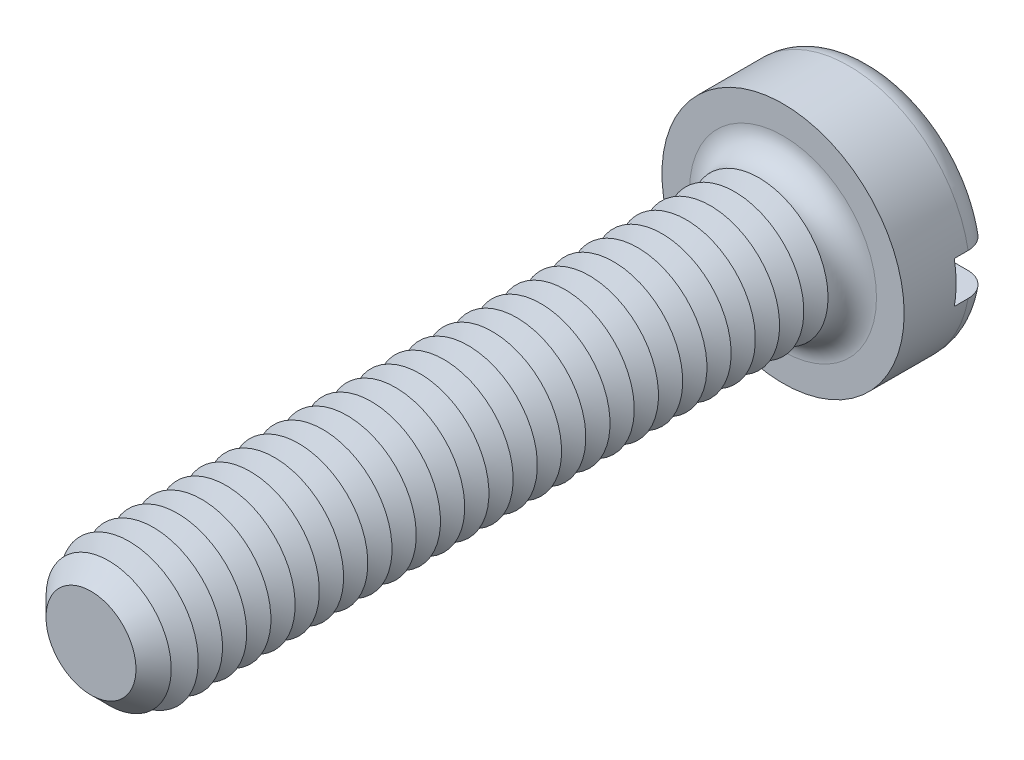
from build123d import *

# Parameters (mm, degrees)
SKETCH3_R           = 3.5
BOSS_EXTRUDE2_DEPTH = 2.6
SKETCH4_R           = 2
BOSS_EXTRUDE3_DEPTH = 20
FILLET1_R           = 0.7
CHAMFER1_SIZE       = 0.7
LPATTERN1_COUNT     = 27
LPATTERN1_PITCH     = 0.7
SKETCH8_W           = 7
SKETCH8_H           = 1.2
CUT_EXTRUDE1_DEPTH  = 1.1


with BuildPart() as part:
    # Sketch3 → Boss-Extrude2 (new body)
    with BuildSketch(Plane.XY):
        Circle(SKETCH3_R)
    extrude(amount=-BOSS_EXTRUDE2_DEPTH)

    # Sketch4 → Boss-Extrude3 (add)
    with BuildSketch(Plane.XY):
        Circle(SKETCH4_R)
    extrude(amount=BOSS_EXTRUDE3_DEPTH)

    # Fillet1
    fillet1_edges = [part.edges().sort_by_distance(p)[0] for p in [
        (-3.5, 0, -2.6),
        (-2, 0, 0),
    ]]
    fillet(fillet1_edges, radius=FILLET1_R)

    # Chamfer1
    chamfer1_edges = [part.edges().sort_by_distance(p)[0] for p in [
        (-2, 0, 20),
    ]]
    chamfer(chamfer1_edges, length=CHAMFER1_SIZE)

    # Sketch6 → Cut-Revolve1 (revolve, cut)
    with BuildSketch(Plane(origin=(0, 0, 0), x_dir=(0, 0, -1), z_dir=(1, 0, 0)), mode=Mode.PRIVATE) as cut_revolve1_sk:
        Polygon((-0.7, 2), (-1.05, 1.393782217), (-1.4, 2), align=None)
    cut_revolve1 = revolve(cut_revolve1_sk.sketch.rotate(Axis((0, 0, -1.694361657), (0, 0, 1)), 90), axis=Axis((0, 0, -1.694361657), (0, 0, 1)), mode=Mode.SUBTRACT)

    # LPattern1: Cut-Revolve1 ×27
    with Locations(*[(0, 0, i * LPATTERN1_PITCH) for i in range(1, LPATTERN1_COUNT)]):
        add(cut_revolve1, mode=Mode.SUBTRACT)

    # Sketch8 → Cut-Extrude1 (cut)
    with BuildSketch(Plane(origin=(0, 0, -2.6), x_dir=(-1, 0, 0), z_dir=(0, 0, -1))):
        Rectangle(SKETCH8_W, SKETCH8_H)
    extrude(amount=-CUT_EXTRUDE1_DEPTH, mode=Mode.SUBTRACT)


solid = part.part
